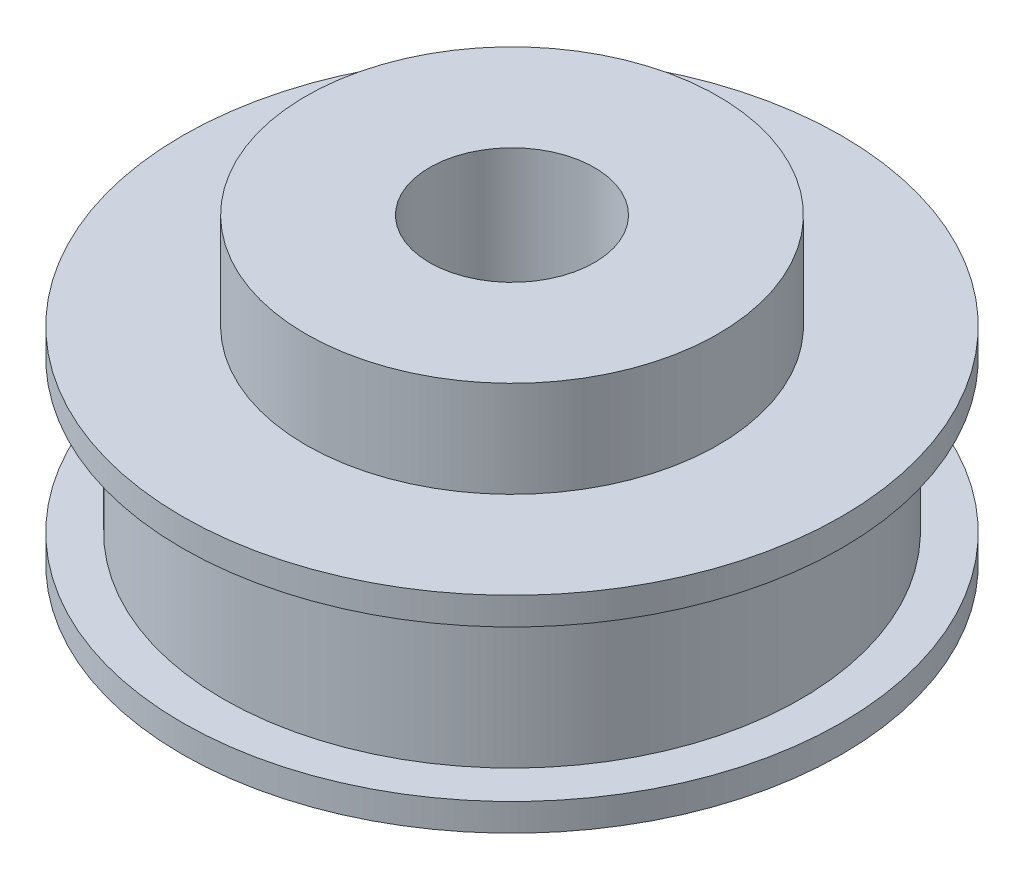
ISO-10303-21;
HEADER;
FILE_DESCRIPTION(('STEP AP214'),'2;1');
FILE_NAME('part.step','',(''),(''),'','','');
FILE_SCHEMA(('AUTOMOTIVE_DESIGN { 1 0 10303 214 1 1 1 1 }'));
ENDSEC;
DATA;
#1=APPLICATION_CONTEXT('core data for automotive mechanical design processes');
#2=APPLICATION_PROTOCOL_DEFINITION('international standard','automotive_design',2000,#1);
#3=PRODUCT_CONTEXT('',#1,'mechanical');
#4=PRODUCT('Part','Part','',(#3));
#5=PRODUCT_RELATED_PRODUCT_CATEGORY('part','',(#4));
#6=PRODUCT_DEFINITION_FORMATION('','',#4);
#7=PRODUCT_DEFINITION_CONTEXT('part definition',#1,'design');
#8=PRODUCT_DEFINITION('design','',#6,#7);
#9=PRODUCT_DEFINITION_SHAPE('','',#8);
#10=(LENGTH_UNIT() NAMED_UNIT(*) SI_UNIT(.MILLI.,.METRE.));
#11=(NAMED_UNIT(*) PLANE_ANGLE_UNIT() SI_UNIT($,.RADIAN.));
#12=(NAMED_UNIT(*) SI_UNIT($,.STERADIAN.) SOLID_ANGLE_UNIT());
#13=UNCERTAINTY_MEASURE_WITH_UNIT(LENGTH_MEASURE(1.E-05),#10,'distance_accuracy_value','');
#14=(GEOMETRIC_REPRESENTATION_CONTEXT(3) GLOBAL_UNCERTAINTY_ASSIGNED_CONTEXT((#13)) GLOBAL_UNIT_ASSIGNED_CONTEXT((#10,
#11,#12)) REPRESENTATION_CONTEXT('',''));
#15=CARTESIAN_POINT('',(0.,0.,0.));
#16=DIRECTION('',(0.,0.,1.));
#17=DIRECTION('',(1.,0.,0.));
#18=AXIS2_PLACEMENT_3D('',#15,#16,#17);
#19=CARTESIAN_POINT('',(0.,15.,0.));
#20=DIRECTION('',(0.,1.,0.));
#21=DIRECTION('',(0.,0.,1.));
#22=AXIS2_PLACEMENT_3D('',#19,#20,#21);
#23=PLANE('',#22);
#24=CARTESIAN_POINT('',(0.,15.,0.));
#25=DIRECTION('',(0.,1.,0.));
#26=DIRECTION('',(0.,0.,1.));
#27=AXIS2_PLACEMENT_3D('',#24,#25,#26);
#28=CIRCLE('',#27,24.);
#29=CARTESIAN_POINT('',(0.,15.,24.));
#30=VERTEX_POINT('',#29);
#31=EDGE_CURVE('E44',#30,#30,#28,.T.);
#32=ORIENTED_EDGE('',*,*,#31,.T.);
#33=EDGE_LOOP('',(#32));
#34=FACE_BOUND('',#33,.T.);
#35=CARTESIAN_POINT('',(0.,15.,0.));
#36=DIRECTION('',(0.,1.,0.));
#37=DIRECTION('',(0.,0.,1.));
#38=AXIS2_PLACEMENT_3D('',#35,#36,#37);
#39=CIRCLE('',#38,15.);
#40=CARTESIAN_POINT('',(0.,15.,15.));
#41=VERTEX_POINT('',#40);
#42=EDGE_CURVE('E53',#41,#41,#39,.T.);
#43=ORIENTED_EDGE('',*,*,#42,.F.);
#44=EDGE_LOOP('',(#43));
#45=FACE_BOUND('',#44,.T.);
#46=ADVANCED_FACE('F28',(#34,#45),#23,.T.);
#47=CARTESIAN_POINT('',(0.,2.,0.));
#48=DIRECTION('',(0.,1.,0.));
#49=DIRECTION('',(0.,0.,1.));
#50=AXIS2_PLACEMENT_3D('',#47,#48,#49);
#51=PLANE('',#50);
#52=CARTESIAN_POINT('',(0.,2.,0.));
#53=DIRECTION('',(0.,1.,0.));
#54=DIRECTION('',(0.,0.,1.));
#55=AXIS2_PLACEMENT_3D('',#52,#53,#54);
#56=CIRCLE('',#55,24.);
#57=CARTESIAN_POINT('',(0.,2.,24.));
#58=VERTEX_POINT('',#57);
#59=EDGE_CURVE('E10',#58,#58,#56,.T.);
#60=ORIENTED_EDGE('',*,*,#59,.T.);
#61=EDGE_LOOP('',(#60));
#62=FACE_BOUND('',#61,.T.);
#63=CARTESIAN_POINT('',(0.,2.,0.));
#64=DIRECTION('',(0.,1.,0.));
#65=DIRECTION('',(0.,0.,1.));
#66=AXIS2_PLACEMENT_3D('',#63,#64,#65);
#67=CIRCLE('',#66,21.02);
#68=CARTESIAN_POINT('',(0.,2.,21.02));
#69=VERTEX_POINT('',#68);
#70=EDGE_CURVE('E41',#69,#69,#67,.T.);
#71=ORIENTED_EDGE('',*,*,#70,.F.);
#72=EDGE_LOOP('',(#71));
#73=FACE_BOUND('',#72,.T.);
#74=ADVANCED_FACE('F88',(#62,#73),#51,.T.);
#75=CARTESIAN_POINT('',(0.,2.,0.));
#76=DIRECTION('',(0.,-1.,0.));
#77=DIRECTION('',(0.,0.,-1.));
#78=AXIS2_PLACEMENT_3D('',#75,#76,#77);
#79=CYLINDRICAL_SURFACE('',#78,24.);
#80=ORIENTED_EDGE('',*,*,#59,.F.);
#81=EDGE_LOOP('',(#80));
#82=FACE_BOUND('',#81,.T.);
#83=CARTESIAN_POINT('',(0.,0.,0.));
#84=DIRECTION('',(0.,1.,0.));
#85=DIRECTION('',(0.,0.,1.));
#86=AXIS2_PLACEMENT_3D('',#83,#84,#85);
#87=CIRCLE('',#86,24.);
#88=CARTESIAN_POINT('',(0.,0.,24.));
#89=VERTEX_POINT('',#88);
#90=EDGE_CURVE('E32',#89,#89,#87,.T.);
#91=ORIENTED_EDGE('',*,*,#90,.T.);
#92=EDGE_LOOP('',(#91));
#93=FACE_BOUND('',#92,.T.);
#94=ADVANCED_FACE('F30',(#82,#93),#79,.T.);
#95=CARTESIAN_POINT('',(0.,0.,0.));
#96=DIRECTION('',(0.,1.,0.));
#97=DIRECTION('',(0.,0.,1.));
#98=AXIS2_PLACEMENT_3D('',#95,#96,#97);
#99=PLANE('',#98);
#100=CARTESIAN_POINT('',(0.,0.,0.));
#101=DIRECTION('',(0.,1.,0.));
#102=DIRECTION('',(0.,0.,1.));
#103=AXIS2_PLACEMENT_3D('',#100,#101,#102);
#104=CIRCLE('',#103,5.99999999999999);
#105=CARTESIAN_POINT('',(0.,0.,5.99999999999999));
#106=VERTEX_POINT('',#105);
#107=EDGE_CURVE('E61',#106,#106,#104,.T.);
#108=ORIENTED_EDGE('',*,*,#107,.T.);
#109=EDGE_LOOP('',(#108));
#110=FACE_BOUND('',#109,.T.);
#111=ORIENTED_EDGE('',*,*,#90,.F.);
#112=EDGE_LOOP('',(#111));
#113=FACE_BOUND('',#112,.T.);
#114=ADVANCED_FACE('F65',(#110,#113),#99,.F.);
#115=CARTESIAN_POINT('',(0.,13.,0.));
#116=DIRECTION('',(0.,-1.,0.));
#117=DIRECTION('',(0.,0.,-1.));
#118=AXIS2_PLACEMENT_3D('',#115,#116,#117);
#119=CYLINDRICAL_SURFACE('',#118,21.02);
#120=CARTESIAN_POINT('',(0.,13.,0.));
#121=DIRECTION('',(0.,1.,0.));
#122=DIRECTION('',(0.,0.,1.));
#123=AXIS2_PLACEMENT_3D('',#120,#121,#122);
#124=CIRCLE('',#123,21.02);
#125=CARTESIAN_POINT('',(0.,13.,21.02));
#126=VERTEX_POINT('',#125);
#127=EDGE_CURVE('E39',#126,#126,#124,.T.);
#128=ORIENTED_EDGE('',*,*,#127,.F.);
#129=EDGE_LOOP('',(#128));
#130=FACE_BOUND('',#129,.T.);
#131=ORIENTED_EDGE('',*,*,#70,.T.);
#132=EDGE_LOOP('',(#131));
#133=FACE_BOUND('',#132,.T.);
#134=ADVANCED_FACE('F99',(#130,#133),#119,.T.);
#135=CARTESIAN_POINT('',(0.,13.,0.));
#136=DIRECTION('',(0.,1.,0.));
#137=DIRECTION('',(0.,0.,1.));
#138=AXIS2_PLACEMENT_3D('',#135,#136,#137);
#139=PLANE('',#138);
#140=CARTESIAN_POINT('',(0.,13.,0.));
#141=DIRECTION('',(0.,1.,0.));
#142=DIRECTION('',(0.,0.,1.));
#143=AXIS2_PLACEMENT_3D('',#140,#141,#142);
#144=CIRCLE('',#143,24.);
#145=CARTESIAN_POINT('',(0.,13.,24.));
#146=VERTEX_POINT('',#145);
#147=EDGE_CURVE('E47',#146,#146,#144,.T.);
#148=ORIENTED_EDGE('',*,*,#147,.F.);
#149=EDGE_LOOP('',(#148));
#150=FACE_BOUND('',#149,.T.);
#151=ORIENTED_EDGE('',*,*,#127,.T.);
#152=EDGE_LOOP('',(#151));
#153=FACE_BOUND('',#152,.T.);
#154=ADVANCED_FACE('F96',(#150,#153),#139,.F.);
#155=CARTESIAN_POINT('',(0.,15.,0.));
#156=DIRECTION('',(0.,-1.,0.));
#157=DIRECTION('',(0.,0.,-1.));
#158=AXIS2_PLACEMENT_3D('',#155,#156,#157);
#159=CYLINDRICAL_SURFACE('',#158,24.);
#160=ORIENTED_EDGE('',*,*,#31,.F.);
#161=EDGE_LOOP('',(#160));
#162=FACE_BOUND('',#161,.T.);
#163=ORIENTED_EDGE('',*,*,#147,.T.);
#164=EDGE_LOOP('',(#163));
#165=FACE_BOUND('',#164,.T.);
#166=ADVANCED_FACE('F83',(#162,#165),#159,.T.);
#167=CARTESIAN_POINT('',(0.,22.,0.));
#168=DIRECTION('',(0.,-1.,0.));
#169=DIRECTION('',(0.,0.,-1.));
#170=AXIS2_PLACEMENT_3D('',#167,#168,#169);
#171=CYLINDRICAL_SURFACE('',#170,15.);
#172=CARTESIAN_POINT('',(0.,22.,0.));
#173=DIRECTION('',(0.,1.,0.));
#174=DIRECTION('',(0.,0.,1.));
#175=AXIS2_PLACEMENT_3D('',#172,#173,#174);
#176=CIRCLE('',#175,15.);
#177=CARTESIAN_POINT('',(0.,22.,15.));
#178=VERTEX_POINT('',#177);
#179=EDGE_CURVE('E50',#178,#178,#176,.T.);
#180=ORIENTED_EDGE('',*,*,#179,.F.);
#181=EDGE_LOOP('',(#180));
#182=FACE_BOUND('',#181,.T.);
#183=ORIENTED_EDGE('',*,*,#42,.T.);
#184=EDGE_LOOP('',(#183));
#185=FACE_BOUND('',#184,.T.);
#186=ADVANCED_FACE('F77',(#182,#185),#171,.T.);
#187=CARTESIAN_POINT('',(0.,22.,0.));
#188=DIRECTION('',(0.,1.,0.));
#189=DIRECTION('',(0.,0.,1.));
#190=AXIS2_PLACEMENT_3D('',#187,#188,#189);
#191=PLANE('',#190);
#192=CARTESIAN_POINT('',(0.,22.,0.));
#193=DIRECTION('',(0.,1.,0.));
#194=DIRECTION('',(0.,0.,1.));
#195=AXIS2_PLACEMENT_3D('',#192,#193,#194);
#196=CIRCLE('',#195,5.99999999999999);
#197=CARTESIAN_POINT('',(0.,22.,5.99999999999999));
#198=VERTEX_POINT('',#197);
#199=EDGE_CURVE('E56',#198,#198,#196,.T.);
#200=ORIENTED_EDGE('',*,*,#199,.F.);
#201=EDGE_LOOP('',(#200));
#202=FACE_BOUND('',#201,.T.);
#203=ORIENTED_EDGE('',*,*,#179,.T.);
#204=EDGE_LOOP('',(#203));
#205=FACE_BOUND('',#204,.T.);
#206=ADVANCED_FACE('F71',(#202,#205),#191,.T.);
#207=CARTESIAN_POINT('',(0.,22.,0.));
#208=DIRECTION('',(0.,1.,0.));
#209=DIRECTION('',(0.,0.,1.));
#210=AXIS2_PLACEMENT_3D('',#207,#208,#209);
#211=CYLINDRICAL_SURFACE('',#210,5.99999999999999);
#212=ORIENTED_EDGE('',*,*,#107,.F.);
#213=EDGE_LOOP('',(#212));
#214=FACE_BOUND('',#213,.T.);
#215=ORIENTED_EDGE('',*,*,#199,.T.);
#216=EDGE_LOOP('',(#215));
#217=FACE_BOUND('',#216,.T.);
#218=ADVANCED_FACE('F68',(#214,#217),#211,.F.);
#219=CLOSED_SHELL('',(#46,#74,#94,#114,#134,#154,#166,#186,#206,#218));
#220=MANIFOLD_SOLID_BREP('B2',#219);
#221=ADVANCED_BREP_SHAPE_REPRESENTATION('',(#18,#220),#14);
#222=SHAPE_DEFINITION_REPRESENTATION(#9,#221);
ENDSEC;
END-ISO-10303-21;
